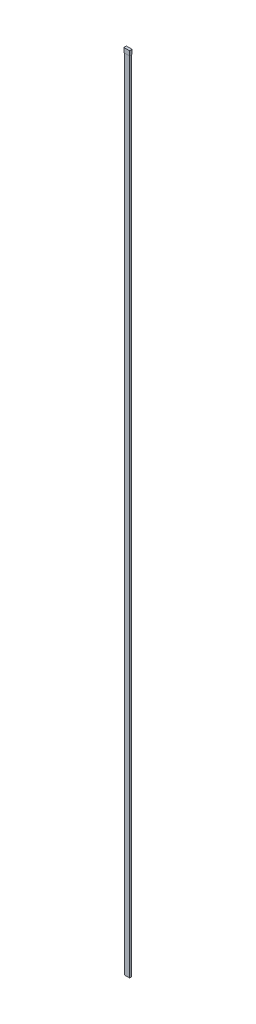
ISO-10303-21;
HEADER;
FILE_DESCRIPTION(('STEP AP214'),'2;1');
FILE_NAME('part.step','',(''),(''),'','','');
FILE_SCHEMA(('AUTOMOTIVE_DESIGN { 1 0 10303 214 1 1 1 1 }'));
ENDSEC;
DATA;
#1=APPLICATION_CONTEXT('core data for automotive mechanical design processes');
#2=APPLICATION_PROTOCOL_DEFINITION('international standard','automotive_design',2000,#1);
#3=PRODUCT_CONTEXT('',#1,'mechanical');
#4=PRODUCT('Part','Part','',(#3));
#5=PRODUCT_RELATED_PRODUCT_CATEGORY('part','',(#4));
#6=PRODUCT_DEFINITION_FORMATION('','',#4);
#7=PRODUCT_DEFINITION_CONTEXT('part definition',#1,'design');
#8=PRODUCT_DEFINITION('design','',#6,#7);
#9=PRODUCT_DEFINITION_SHAPE('','',#8);
#10=(LENGTH_UNIT() NAMED_UNIT(*) SI_UNIT(.MILLI.,.METRE.));
#11=(NAMED_UNIT(*) PLANE_ANGLE_UNIT() SI_UNIT($,.RADIAN.));
#12=(NAMED_UNIT(*) SI_UNIT($,.STERADIAN.) SOLID_ANGLE_UNIT());
#13=UNCERTAINTY_MEASURE_WITH_UNIT(LENGTH_MEASURE(1.E-05),#10,'distance_accuracy_value','');
#14=(GEOMETRIC_REPRESENTATION_CONTEXT(3) GLOBAL_UNCERTAINTY_ASSIGNED_CONTEXT((#13)) GLOBAL_UNIT_ASSIGNED_CONTEXT((#10,
#11,#12)) REPRESENTATION_CONTEXT('',''));
#15=CARTESIAN_POINT('',(0.,0.,0.));
#16=DIRECTION('',(0.,0.,1.));
#17=DIRECTION('',(1.,0.,0.));
#18=AXIS2_PLACEMENT_3D('',#15,#16,#17);
#19=CARTESIAN_POINT('',(6.35000000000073,-1994.443749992,2.38125));
#20=DIRECTION('',(-1.,0.,0.));
#21=DIRECTION('',(0.,-1.,0.));
#22=AXIS2_PLACEMENT_3D('',#19,#20,#21);
#23=PLANE('',#22);
#24=DIRECTION('',(0.,1.,0.));
#25=VECTOR('',#24,1.);
#26=CARTESIAN_POINT('',(6.35000000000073,-1994.443749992,-2.38125));
#27=LINE('',#26,#25);
#28=CARTESIAN_POINT('',(6.35000000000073,-1994.443749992,-2.38125));
#29=VERTEX_POINT('',#28);
#30=CARTESIAN_POINT('',(6.35,-5.55625,-2.38125));
#31=VERTEX_POINT('',#30);
#32=EDGE_CURVE('E131',#29,#31,#27,.T.);
#33=ORIENTED_EDGE('',*,*,#32,.T.);
#34=DIRECTION('',(0.,0.,-1.));
#35=VECTOR('',#34,1.);
#36=CARTESIAN_POINT('',(6.35,-5.55625,2.38125));
#37=LINE('',#36,#35);
#38=CARTESIAN_POINT('',(6.35,-5.55625,2.38125));
#39=VERTEX_POINT('',#38);
#40=EDGE_CURVE('E11',#39,#31,#37,.T.);
#41=ORIENTED_EDGE('',*,*,#40,.F.);
#42=DIRECTION('',(0.,1.,0.));
#43=VECTOR('',#42,1.);
#44=CARTESIAN_POINT('',(6.35000000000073,-1994.443749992,2.38125));
#45=LINE('',#44,#43);
#46=CARTESIAN_POINT('',(6.35000000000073,-1994.443749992,2.38125));
#47=VERTEX_POINT('',#46);
#48=EDGE_CURVE('E76',#47,#39,#45,.T.);
#49=ORIENTED_EDGE('',*,*,#48,.F.);
#50=DIRECTION('',(0.,0.,-1.));
#51=VECTOR('',#50,1.);
#52=CARTESIAN_POINT('',(6.35000000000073,-1994.443749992,2.38125));
#53=LINE('',#52,#51);
#54=EDGE_CURVE('E145',#47,#29,#53,.T.);
#55=ORIENTED_EDGE('',*,*,#54,.T.);
#56=EDGE_LOOP('',(#33,#41,#49,#55));
#57=FACE_BOUND('',#56,.T.);
#58=ADVANCED_FACE('F34',(#57),#23,.F.);
#59=CARTESIAN_POINT('',(-6.35,-1994.443749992,2.38125));
#60=DIRECTION('',(1.,0.,0.));
#61=DIRECTION('',(0.,1.,0.));
#62=AXIS2_PLACEMENT_3D('',#59,#60,#61);
#63=PLANE('',#62);
#64=DIRECTION('',(0.,-1.,0.));
#65=VECTOR('',#64,1.);
#66=CARTESIAN_POINT('',(-6.35,-1994.443749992,-2.38125));
#67=LINE('',#66,#65);
#68=CARTESIAN_POINT('',(-6.35,-5.55625,-2.38125));
#69=VERTEX_POINT('',#68);
#70=CARTESIAN_POINT('',(-6.35,-1994.443749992,-2.38125));
#71=VERTEX_POINT('',#70);
#72=EDGE_CURVE('E65',#69,#71,#67,.T.);
#73=ORIENTED_EDGE('',*,*,#72,.T.);
#74=DIRECTION('',(0.,0.,-1.));
#75=VECTOR('',#74,1.);
#76=CARTESIAN_POINT('',(-6.35,-1994.443749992,2.38125));
#77=LINE('',#76,#75);
#78=CARTESIAN_POINT('',(-6.35,-1994.443749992,2.38125));
#79=VERTEX_POINT('',#78);
#80=EDGE_CURVE('E152',#79,#71,#77,.T.);
#81=ORIENTED_EDGE('',*,*,#80,.F.);
#82=DIRECTION('',(0.,-1.,0.));
#83=VECTOR('',#82,1.);
#84=CARTESIAN_POINT('',(-6.35,-1994.443749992,2.38125));
#85=LINE('',#84,#83);
#86=CARTESIAN_POINT('',(-6.35,-5.55625,2.38125));
#87=VERTEX_POINT('',#86);
#88=EDGE_CURVE('E143',#87,#79,#85,.T.);
#89=ORIENTED_EDGE('',*,*,#88,.F.);
#90=DIRECTION('',(0.,0.,-1.));
#91=VECTOR('',#90,1.);
#92=CARTESIAN_POINT('',(-6.35,-5.55625,2.38125));
#93=LINE('',#92,#91);
#94=EDGE_CURVE('E42',#87,#69,#93,.T.);
#95=ORIENTED_EDGE('',*,*,#94,.T.);
#96=EDGE_LOOP('',(#73,#81,#89,#95));
#97=FACE_BOUND('',#96,.T.);
#98=ADVANCED_FACE('F155',(#97),#63,.F.);
#99=CARTESIAN_POINT('',(-6.35,-1994.443749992,2.38125));
#100=DIRECTION('',(0.,1.,0.));
#101=DIRECTION('',(0.,0.,1.));
#102=AXIS2_PLACEMENT_3D('',#99,#100,#101);
#103=PLANE('',#102);
#104=DIRECTION('',(1.,0.,0.));
#105=VECTOR('',#104,1.);
#106=CARTESIAN_POINT('',(-6.35,-1994.443749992,-2.38125));
#107=LINE('',#106,#105);
#108=EDGE_CURVE('E71',#71,#29,#107,.T.);
#109=ORIENTED_EDGE('',*,*,#108,.T.);
#110=ORIENTED_EDGE('',*,*,#54,.F.);
#111=DIRECTION('',(1.,0.,0.));
#112=VECTOR('',#111,1.);
#113=CARTESIAN_POINT('',(-6.35,-1994.443749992,2.38125));
#114=LINE('',#113,#112);
#115=EDGE_CURVE('E50',#79,#47,#114,.T.);
#116=ORIENTED_EDGE('',*,*,#115,.F.);
#117=ORIENTED_EDGE('',*,*,#80,.T.);
#118=EDGE_LOOP('',(#109,#110,#116,#117));
#119=FACE_BOUND('',#118,.T.);
#120=ADVANCED_FACE('F163',(#119),#103,.F.);
#121=CARTESIAN_POINT('',(0.,0.,2.38125));
#122=DIRECTION('',(0.,0.,-1.));
#123=DIRECTION('',(-1.,0.,0.));
#124=AXIS2_PLACEMENT_3D('',#121,#122,#123);
#125=PLANE('',#124);
#126=ORIENTED_EDGE('',*,*,#48,.T.);
#127=DIRECTION('',(-1.,0.,0.));
#128=VECTOR('',#127,1.);
#129=CARTESIAN_POINT('',(-6.35,-5.55625,2.38125));
#130=LINE('',#129,#128);
#131=EDGE_CURVE('E141',#39,#87,#130,.T.);
#132=ORIENTED_EDGE('',*,*,#131,.T.);
#133=ORIENTED_EDGE('',*,*,#88,.T.);
#134=ORIENTED_EDGE('',*,*,#115,.T.);
#135=EDGE_LOOP('',(#126,#132,#133,#134));
#136=FACE_BOUND('',#135,.T.);
#137=ADVANCED_FACE('F165',(#136),#125,.F.);
#138=CARTESIAN_POINT('',(0.,0.,-2.38125));
#139=DIRECTION('',(0.,0.,-1.));
#140=DIRECTION('',(-1.,0.,0.));
#141=AXIS2_PLACEMENT_3D('',#138,#139,#140);
#142=PLANE('',#141);
#143=ORIENTED_EDGE('',*,*,#32,.F.);
#144=ORIENTED_EDGE('',*,*,#108,.F.);
#145=ORIENTED_EDGE('',*,*,#72,.F.);
#146=DIRECTION('',(-1.,0.,0.));
#147=VECTOR('',#146,1.);
#148=CARTESIAN_POINT('',(-6.35,-5.55625,-2.38125));
#149=LINE('',#148,#147);
#150=EDGE_CURVE('E134',#31,#69,#149,.T.);
#151=ORIENTED_EDGE('',*,*,#150,.F.);
#152=EDGE_LOOP('',(#143,#144,#145,#151));
#153=FACE_BOUND('',#152,.T.);
#154=ADVANCED_FACE('F161',(#153),#142,.T.);
#155=CARTESIAN_POINT('',(-7.14375,-5.55625,3.175));
#156=DIRECTION('',(0.,1.,0.));
#157=DIRECTION('',(0.,0.,1.));
#158=AXIS2_PLACEMENT_3D('',#155,#156,#157);
#159=PLANE('',#158);
#160=DIRECTION('',(1.,0.,0.));
#161=VECTOR('',#160,1.);
#162=CARTESIAN_POINT('',(-7.14375,-5.55625,-3.175));
#163=LINE('',#162,#161);
#164=CARTESIAN_POINT('',(-7.14375,-5.55625,-3.175));
#165=VERTEX_POINT('',#164);
#166=CARTESIAN_POINT('',(7.14375,-5.55625,-3.175));
#167=VERTEX_POINT('',#166);
#168=EDGE_CURVE('E126',#165,#167,#163,.T.);
#169=ORIENTED_EDGE('',*,*,#168,.T.);
#170=DIRECTION('',(0.,0.,-1.));
#171=VECTOR('',#170,1.);
#172=CARTESIAN_POINT('',(7.14375,-5.55625,3.175));
#173=LINE('',#172,#171);
#174=CARTESIAN_POINT('',(7.14375,-5.55625,3.175));
#175=VERTEX_POINT('',#174);
#176=EDGE_CURVE('E262',#175,#167,#173,.T.);
#177=ORIENTED_EDGE('',*,*,#176,.F.);
#178=DIRECTION('',(1.,0.,0.));
#179=VECTOR('',#178,1.);
#180=CARTESIAN_POINT('',(-7.14375,-5.55625,3.175));
#181=LINE('',#180,#179);
#182=CARTESIAN_POINT('',(-7.14375,-5.55625,3.175));
#183=VERTEX_POINT('',#182);
#184=EDGE_CURVE('E122',#183,#175,#181,.T.);
#185=ORIENTED_EDGE('',*,*,#184,.F.);
#186=DIRECTION('',(0.,0.,-1.));
#187=VECTOR('',#186,1.);
#188=CARTESIAN_POINT('',(-7.14375,-5.55625,3.175));
#189=LINE('',#188,#187);
#190=EDGE_CURVE('E136',#183,#165,#189,.T.);
#191=ORIENTED_EDGE('',*,*,#190,.T.);
#192=EDGE_LOOP('',(#169,#177,#185,#191));
#193=FACE_BOUND('',#192,.T.);
#194=ORIENTED_EDGE('',*,*,#94,.F.);
#195=ORIENTED_EDGE('',*,*,#131,.F.);
#196=ORIENTED_EDGE('',*,*,#40,.T.);
#197=ORIENTED_EDGE('',*,*,#150,.T.);
#198=EDGE_LOOP('',(#194,#195,#196,#197));
#199=FACE_BOUND('',#198,.T.);
#200=ADVANCED_FACE('F158',(#193,#199),#159,.F.);
#201=CARTESIAN_POINT('',(7.14375,-5.55625,3.175));
#202=DIRECTION('',(-1.,0.,0.));
#203=DIRECTION('',(0.,0.,1.));
#204=AXIS2_PLACEMENT_3D('',#201,#202,#203);
#205=PLANE('',#204);
#206=DIRECTION('',(0.,1.,0.));
#207=VECTOR('',#206,1.);
#208=CARTESIAN_POINT('',(7.14375,-5.55625,-3.175));
#209=LINE('',#208,#207);
#210=CARTESIAN_POINT('',(7.14375,5.55625,-3.175));
#211=VERTEX_POINT('',#210);
#212=EDGE_CURVE('E130',#167,#211,#209,.T.);
#213=ORIENTED_EDGE('',*,*,#212,.T.);
#214=DIRECTION('',(0.,0.,-1.));
#215=VECTOR('',#214,1.);
#216=CARTESIAN_POINT('',(7.14375,5.55625,3.175));
#217=LINE('',#216,#215);
#218=CARTESIAN_POINT('',(7.14375,5.55625,3.175));
#219=VERTEX_POINT('',#218);
#220=EDGE_CURVE('E110',#219,#211,#217,.T.);
#221=ORIENTED_EDGE('',*,*,#220,.F.);
#222=DIRECTION('',(0.,1.,0.));
#223=VECTOR('',#222,1.);
#224=CARTESIAN_POINT('',(7.14375,-5.55625,3.175));
#225=LINE('',#224,#223);
#226=EDGE_CURVE('E117',#175,#219,#225,.T.);
#227=ORIENTED_EDGE('',*,*,#226,.F.);
#228=ORIENTED_EDGE('',*,*,#176,.T.);
#229=EDGE_LOOP('',(#213,#221,#227,#228));
#230=FACE_BOUND('',#229,.T.);
#231=ADVANCED_FACE('F128',(#230),#205,.F.);
#232=CARTESIAN_POINT('',(-7.14375,5.55625,3.175));
#233=DIRECTION('',(0.,-1.,0.));
#234=DIRECTION('',(0.,0.,-1.));
#235=AXIS2_PLACEMENT_3D('',#232,#233,#234);
#236=PLANE('',#235);
#237=DIRECTION('',(-1.,0.,0.));
#238=VECTOR('',#237,1.);
#239=CARTESIAN_POINT('',(-7.14375,5.55625,-3.175));
#240=LINE('',#239,#238);
#241=CARTESIAN_POINT('',(-7.14375,5.55625,-3.175));
#242=VERTEX_POINT('',#241);
#243=EDGE_CURVE('E253',#211,#242,#240,.T.);
#244=ORIENTED_EDGE('',*,*,#243,.T.);
#245=DIRECTION('',(0.,0.,-1.));
#246=VECTOR('',#245,1.);
#247=CARTESIAN_POINT('',(-7.14375,5.55625,3.175));
#248=LINE('',#247,#246);
#249=CARTESIAN_POINT('',(-7.14375,5.55625,3.175));
#250=VERTEX_POINT('',#249);
#251=EDGE_CURVE('E113',#250,#242,#248,.T.);
#252=ORIENTED_EDGE('',*,*,#251,.F.);
#253=DIRECTION('',(-1.,0.,0.));
#254=VECTOR('',#253,1.);
#255=CARTESIAN_POINT('',(-7.14375,5.55625,3.175));
#256=LINE('',#255,#254);
#257=EDGE_CURVE('E106',#219,#250,#256,.T.);
#258=ORIENTED_EDGE('',*,*,#257,.F.);
#259=ORIENTED_EDGE('',*,*,#220,.T.);
#260=EDGE_LOOP('',(#244,#252,#258,#259));
#261=FACE_BOUND('',#260,.T.);
#262=ADVANCED_FACE('F108',(#261),#236,.F.);
#263=CARTESIAN_POINT('',(-7.14375,-5.55625,3.175));
#264=DIRECTION('',(1.,0.,0.));
#265=DIRECTION('',(0.,0.,-1.));
#266=AXIS2_PLACEMENT_3D('',#263,#264,#265);
#267=PLANE('',#266);
#268=DIRECTION('',(0.,-1.,0.));
#269=VECTOR('',#268,1.);
#270=CARTESIAN_POINT('',(-7.14375,-5.55625,-3.175));
#271=LINE('',#270,#269);
#272=EDGE_CURVE('E255',#242,#165,#271,.T.);
#273=ORIENTED_EDGE('',*,*,#272,.T.);
#274=ORIENTED_EDGE('',*,*,#190,.F.);
#275=DIRECTION('',(0.,-1.,0.));
#276=VECTOR('',#275,1.);
#277=CARTESIAN_POINT('',(-7.14375,-5.55625,3.175));
#278=LINE('',#277,#276);
#279=EDGE_CURVE('E116',#250,#183,#278,.T.);
#280=ORIENTED_EDGE('',*,*,#279,.F.);
#281=ORIENTED_EDGE('',*,*,#251,.T.);
#282=EDGE_LOOP('',(#273,#274,#280,#281));
#283=FACE_BOUND('',#282,.T.);
#284=ADVANCED_FACE('F220',(#283),#267,.F.);
#285=CARTESIAN_POINT('',(0.,0.,3.175));
#286=DIRECTION('',(0.,0.,-1.));
#287=DIRECTION('',(-1.,0.,0.));
#288=AXIS2_PLACEMENT_3D('',#285,#286,#287);
#289=PLANE('',#288);
#290=ORIENTED_EDGE('',*,*,#226,.T.);
#291=ORIENTED_EDGE('',*,*,#257,.T.);
#292=ORIENTED_EDGE('',*,*,#279,.T.);
#293=ORIENTED_EDGE('',*,*,#184,.T.);
#294=EDGE_LOOP('',(#290,#291,#292,#293));
#295=FACE_BOUND('',#294,.T.);
#296=ADVANCED_FACE('F120',(#295),#289,.F.);
#297=CARTESIAN_POINT('',(0.,0.,-3.175));
#298=DIRECTION('',(0.,0.,-1.));
#299=DIRECTION('',(-1.,0.,0.));
#300=AXIS2_PLACEMENT_3D('',#297,#298,#299);
#301=PLANE('',#300);
#302=ORIENTED_EDGE('',*,*,#212,.F.);
#303=ORIENTED_EDGE('',*,*,#168,.F.);
#304=ORIENTED_EDGE('',*,*,#272,.F.);
#305=ORIENTED_EDGE('',*,*,#243,.F.);
#306=EDGE_LOOP('',(#302,#303,#304,#305));
#307=FACE_BOUND('',#306,.T.);
#308=ADVANCED_FACE('F238',(#307),#301,.T.);
#309=CLOSED_SHELL('',(#58,#98,#120,#137,#154,#200,#231,#262,#284,#296,#308));
#310=MANIFOLD_SOLID_BREP('B2',#309);
#311=ADVANCED_BREP_SHAPE_REPRESENTATION('',(#18,#310),#14);
#312=SHAPE_DEFINITION_REPRESENTATION(#9,#311);
ENDSEC;
END-ISO-10303-21;
